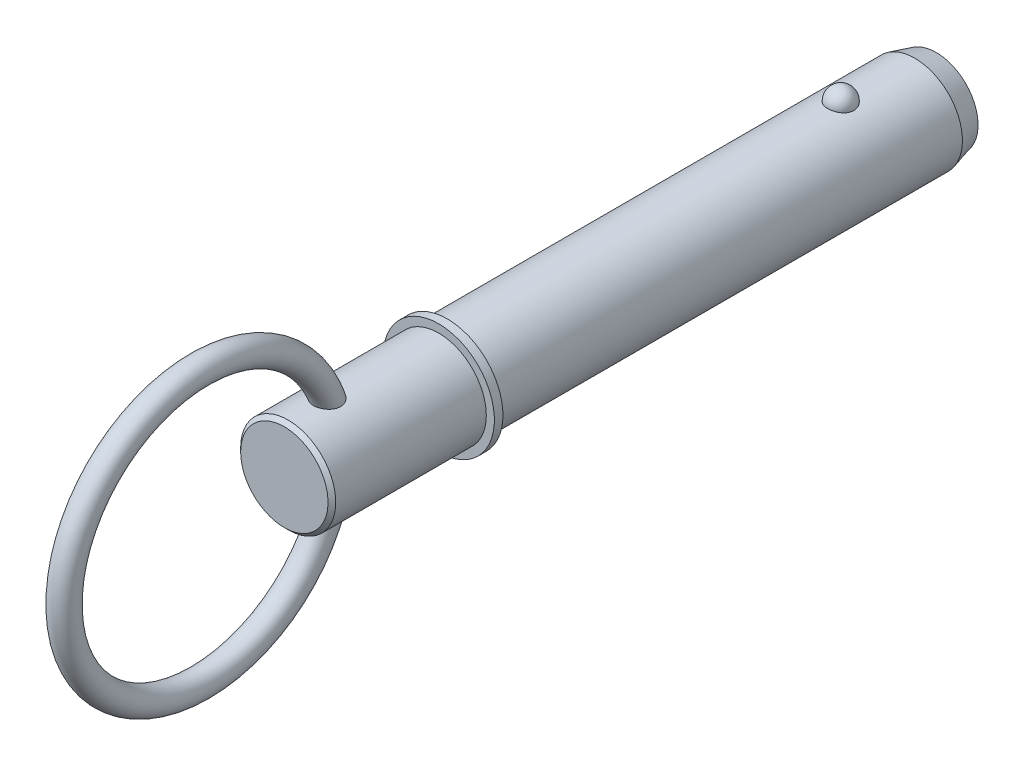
ISO-10303-21;
HEADER;
FILE_DESCRIPTION(('STEP AP214'),'2;1');
FILE_NAME('part.step','',(''),(''),'','','');
FILE_SCHEMA(('AUTOMOTIVE_DESIGN { 1 0 10303 214 1 1 1 1 }'));
ENDSEC;
DATA;
#1=APPLICATION_CONTEXT('core data for automotive mechanical design processes');
#2=APPLICATION_PROTOCOL_DEFINITION('international standard','automotive_design',2000,#1);
#3=PRODUCT_CONTEXT('',#1,'mechanical');
#4=PRODUCT('Part','Part','',(#3));
#5=PRODUCT_RELATED_PRODUCT_CATEGORY('part','',(#4));
#6=PRODUCT_DEFINITION_FORMATION('','',#4);
#7=PRODUCT_DEFINITION_CONTEXT('part definition',#1,'design');
#8=PRODUCT_DEFINITION('design','',#6,#7);
#9=PRODUCT_DEFINITION_SHAPE('','',#8);
#10=(LENGTH_UNIT() NAMED_UNIT(*) SI_UNIT(.MILLI.,.METRE.));
#11=(NAMED_UNIT(*) PLANE_ANGLE_UNIT() SI_UNIT($,.RADIAN.));
#12=(NAMED_UNIT(*) SI_UNIT($,.STERADIAN.) SOLID_ANGLE_UNIT());
#13=UNCERTAINTY_MEASURE_WITH_UNIT(LENGTH_MEASURE(1.E-05),#10,'distance_accuracy_value','');
#14=(GEOMETRIC_REPRESENTATION_CONTEXT(3) GLOBAL_UNCERTAINTY_ASSIGNED_CONTEXT((#13)) GLOBAL_UNIT_ASSIGNED_CONTEXT((#10,
#11,#12)) REPRESENTATION_CONTEXT('',''));
#15=CARTESIAN_POINT('',(0.,0.,0.));
#16=DIRECTION('',(0.,0.,1.));
#17=DIRECTION('',(1.,0.,0.));
#18=AXIS2_PLACEMENT_3D('',#15,#16,#17);
#19=CARTESIAN_POINT('',(0.,0.,88.9));
#20=DIRECTION('',(0.,0.,-1.));
#21=DIRECTION('',(-1.,0.,0.));
#22=AXIS2_PLACEMENT_3D('',#19,#20,#21);
#23=CYLINDRICAL_SURFACE('',#22,11.115);
#24=CARTESIAN_POINT('',(3.04058343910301,10.6910278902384,-3.07));
#25=CARTESIAN_POINT('',(3.04058039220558,10.6910304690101,-2.89837124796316));
#26=CARTESIAN_POINT('',(3.02657193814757,10.6950430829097,-2.72670368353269));
#27=CARTESIAN_POINT('',(2.97087341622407,10.7106465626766,-2.38822964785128));
#28=CARTESIAN_POINT('',(2.92917240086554,10.7222404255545,-2.22142512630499));
#29=CARTESIAN_POINT('',(2.81915317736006,10.751689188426,-1.89750816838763));
#30=CARTESIAN_POINT('',(2.75084669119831,10.7695413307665,-1.7403914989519));
#31=CARTESIAN_POINT('',(2.58932284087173,10.809510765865,-1.44013959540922));
#32=CARTESIAN_POINT('',(2.49610617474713,10.8316279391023,-1.29700396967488));
#33=CARTESIAN_POINT('',(2.28659317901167,10.877786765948,-1.02797591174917));
#34=CARTESIAN_POINT('',(2.17018825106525,10.9018371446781,-0.902169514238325));
#35=CARTESIAN_POINT('',(1.91759004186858,10.9490888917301,-0.672091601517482));
#36=CARTESIAN_POINT('',(1.78139672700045,10.9722902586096,-0.567820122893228));
#37=CARTESIAN_POINT('',(1.49327884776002,11.0151925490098,-0.383992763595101));
#38=CARTESIAN_POINT('',(1.34139928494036,11.034903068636,-0.304368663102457));
#39=CARTESIAN_POINT('',(1.02584823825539,11.0686948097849,-0.171731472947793));
#40=CARTESIAN_POINT('',(0.86217801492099,11.0827766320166,-0.118715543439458));
#41=CARTESIAN_POINT('',(0.530748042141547,11.1035404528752,-0.0415304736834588));
#42=CARTESIAN_POINT('',(0.363109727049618,11.1103474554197,-0.0168734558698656));
#43=CARTESIAN_POINT('',(0.0259327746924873,11.1162480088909,0.00453486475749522));
#44=CARTESIAN_POINT('',(-0.143605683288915,11.1153422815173,0.00128877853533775));
#45=CARTESIAN_POINT('',(-0.477280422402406,11.1059854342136,-0.0327676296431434));
#46=CARTESIAN_POINT('',(-0.641459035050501,11.0976393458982,-0.0631942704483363));
#47=CARTESIAN_POINT('',(-0.962236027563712,11.0744390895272,-0.150220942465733));
#48=CARTESIAN_POINT('',(-1.11883427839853,11.0595848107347,-0.206821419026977));
#49=CARTESIAN_POINT('',(-1.4210461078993,11.0248420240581,-0.345028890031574));
#50=CARTESIAN_POINT('',(-1.56659244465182,11.0049254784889,-0.426775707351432));
#51=CARTESIAN_POINT('',(-1.84189316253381,10.9622119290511,-0.612956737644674));
#52=CARTESIAN_POINT('',(-1.97164597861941,10.9394146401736,-0.717393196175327));
#53=CARTESIAN_POINT('',(-2.21432263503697,10.8929139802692,-0.948332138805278));
#54=CARTESIAN_POINT('',(-2.3268890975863,10.8692016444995,-1.07520847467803));
#55=CARTESIAN_POINT('',(-2.52940007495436,10.8238699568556,-1.34622145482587));
#56=CARTESIAN_POINT('',(-2.6193430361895,10.8022507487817,-1.49035928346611));
#57=CARTESIAN_POINT('',(-2.77523958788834,10.7632629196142,-1.79367507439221));
#58=CARTESIAN_POINT('',(-2.8409151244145,10.7459442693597,-1.95300253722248));
#59=CARTESIAN_POINT('',(-2.94519180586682,10.7178360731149,-2.28083009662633));
#60=CARTESIAN_POINT('',(-2.98379371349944,10.707046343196,-2.44932993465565));
#61=CARTESIAN_POINT('',(-3.03284665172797,10.6932559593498,-2.78998091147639));
#62=CARTESIAN_POINT('',(-3.04341313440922,10.6902233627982,-2.96211412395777));
#63=CARTESIAN_POINT('',(-3.03646037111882,10.6922002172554,-3.30576225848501));
#64=CARTESIAN_POINT('',(-3.0189418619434,10.6972094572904,-3.47727719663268));
#65=CARTESIAN_POINT('',(-2.95641582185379,10.7146564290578,-3.81396465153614));
#66=CARTESIAN_POINT('',(-2.91154117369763,10.7270582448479,-3.97916375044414));
#67=CARTESIAN_POINT('',(-2.79553341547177,10.7578713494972,-4.29947360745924));
#68=CARTESIAN_POINT('',(-2.72439927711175,10.7762828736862,-4.45458397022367));
#69=CARTESIAN_POINT('',(-2.55718900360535,10.8171819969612,-4.75123550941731));
#70=CARTESIAN_POINT('',(-2.46098224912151,10.8396907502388,-4.89270014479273));
#71=CARTESIAN_POINT('',(-2.24623042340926,10.8862165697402,-5.15724095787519));
#72=CARTESIAN_POINT('',(-2.12768452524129,10.9102336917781,-5.28031645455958));
#73=CARTESIAN_POINT('',(-1.87085107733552,10.9571990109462,-5.50509615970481));
#74=CARTESIAN_POINT('',(-1.73249451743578,10.9801430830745,-5.60672245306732));
#75=CARTESIAN_POINT('',(-1.44010079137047,11.0223008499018,-5.78517789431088));
#76=CARTESIAN_POINT('',(-1.28606470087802,11.0415148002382,-5.86200874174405));
#77=CARTESIAN_POINT('',(-0.968615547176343,11.0738491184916,-5.98788441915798));
#78=CARTESIAN_POINT('',(-0.805339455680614,11.0870408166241,-6.03725610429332));
#79=CARTESIAN_POINT('',(-0.47244987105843,11.1062048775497,-6.10820004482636));
#80=CARTESIAN_POINT('',(-0.302837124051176,11.11217808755,-6.12977556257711));
#81=CARTESIAN_POINT('',(0.0345765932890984,11.1162034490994,-6.1443619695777));
#82=CARTESIAN_POINT('',(0.20235372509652,11.1143988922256,-6.13788957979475));
#83=CARTESIAN_POINT('',(0.534364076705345,11.103390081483,-6.09773981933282));
#84=CARTESIAN_POINT('',(0.698597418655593,11.094186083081,-6.06406338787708));
#85=CARTESIAN_POINT('',(1.01830314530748,11.0694136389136,-5.97063285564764));
#86=CARTESIAN_POINT('',(1.17380497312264,11.0538682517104,-5.91097318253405));
#87=CARTESIAN_POINT('',(1.472484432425,11.0180608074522,-5.76723645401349));
#88=CARTESIAN_POINT('',(1.6156613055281,10.9977984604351,-5.68315789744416));
#89=CARTESIAN_POINT('',(1.88801614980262,10.9543574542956,-5.49138807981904));
#90=CARTESIAN_POINT('',(2.01695079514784,10.9311394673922,-5.38336024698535));
#91=CARTESIAN_POINT('',(2.25501495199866,10.8845248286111,-5.14733839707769));
#92=CARTESIAN_POINT('',(2.36414099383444,10.8611281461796,-5.01934088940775));
#93=CARTESIAN_POINT('',(2.56152595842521,10.8162958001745,-4.74447932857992));
#94=CARTESIAN_POINT('',(2.64940088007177,10.7948999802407,-4.59733288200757));
#95=CARTESIAN_POINT('',(2.79961494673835,10.7569242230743,-4.29001203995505));
#96=CARTESIAN_POINT('',(2.86196390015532,10.7403424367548,-4.1298426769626));
#97=CARTESIAN_POINT('',(2.95377333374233,10.715429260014,-3.82062342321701));
#98=CARTESIAN_POINT('',(2.98627018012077,10.7063495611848,-3.67252681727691));
#99=CARTESIAN_POINT('',(3.02967634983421,10.6941478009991,-3.37296350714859));
#100=CARTESIAN_POINT('',(3.04058612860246,10.6910256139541,-3.2214968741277));
#101=CARTESIAN_POINT('',(3.04058343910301,10.6910278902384,-3.07));
#102=B_SPLINE_CURVE_WITH_KNOTS('',3,(#24,#25,#26,#27,#28,#29,#30,#31,#32,#33,#34,#35,#36,#37,
#38,#39,#40,#41,#42,#43,#44,#45,#46,#47,#48,#49,#50,#51,#52,#53,#54,#55,#56,#57,#58,#59,#60,#61,
#62,#63,#64,#65,#66,#67,#68,#69,#70,#71,#72,#73,#74,#75,#76,#77,#78,#79,#80,#81,#82,#83,#84,#85,
#86,#87,#88,#89,#90,#91,#92,#93,#94,#95,#96,#97,#98,#99,#100,#101),.UNSPECIFIED.,.T.,.F.,(4,2,2,
2,2,2,2,2,2,2,2,2,2,2,2,2,2,2,2,2,2,2,2,2,2,2,2,2,2,2,2,2,2,2,2,2,2,2,4),(0.,0.514341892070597,
1.02888723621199,1.54320613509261,2.0575106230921,2.57428293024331,3.09105611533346,
3.60638589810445,4.1216606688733,4.62793159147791,5.1341551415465,5.63334381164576,
6.13254097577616,6.63456562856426,7.13663998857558,7.64804063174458,8.15947638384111,
8.6766026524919,9.19371435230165,9.70869321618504,10.223658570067,10.7361421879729,
11.2486458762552,11.7638748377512,12.2791228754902,12.7962115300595,13.3132647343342,
13.8240238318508,14.3347229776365,14.8360540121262,15.3373677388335,15.8368746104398,
16.3364121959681,16.8434736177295,17.3506237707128,17.8663484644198,18.3818748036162,
18.8358944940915,19.2899046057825),.UNSPECIFIED.);
#103=CARTESIAN_POINT('',(3.04058343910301,10.6910278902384,-3.07));
#104=VERTEX_POINT('',#103);
#105=EDGE_CURVE('E102',#104,#104,#102,.T.);
#106=ORIENTED_EDGE('',*,*,#105,.T.);
#107=EDGE_LOOP('',(#106));
#108=FACE_BOUND('',#107,.T.);
#109=CARTESIAN_POINT('',(0.,0.,-20.3999999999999));
#110=DIRECTION('',(0.,0.,-1.));
#111=DIRECTION('',(-1.,0.,0.));
#112=AXIS2_PLACEMENT_3D('',#109,#110,#111);
#113=CIRCLE('',#112,11.115);
#114=CARTESIAN_POINT('',(-11.115,0.,-20.3999999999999));
#115=VERTEX_POINT('',#114);
#116=EDGE_CURVE('E109',#115,#115,#113,.F.);
#117=ORIENTED_EDGE('',*,*,#116,.T.);
#118=EDGE_LOOP('',(#117));
#119=FACE_BOUND('',#118,.T.);
#120=CARTESIAN_POINT('',(0.,0.,88.9));
#121=DIRECTION('',(0.,0.,1.));
#122=DIRECTION('',(1.,0.,0.));
#123=AXIS2_PLACEMENT_3D('',#120,#121,#122);
#124=CIRCLE('',#123,11.115);
#125=CARTESIAN_POINT('',(11.115,0.,88.9));
#126=VERTEX_POINT('',#125);
#127=EDGE_CURVE('E107',#126,#126,#124,.T.);
#128=ORIENTED_EDGE('',*,*,#127,.F.);
#129=EDGE_LOOP('',(#128));
#130=FACE_BOUND('',#129,.T.);
#131=ADVANCED_FACE('F39',(#108,#119,#130),#23,.T.);
#132=CARTESIAN_POINT('',(0.,0.,-25.4));
#133=DIRECTION('',(0.,0.,-1.));
#134=DIRECTION('',(-1.,0.,0.));
#135=AXIS2_PLACEMENT_3D('',#132,#133,#134);
#136=PLANE('',#135);
#137=CARTESIAN_POINT('',(0.,0.,-25.4));
#138=DIRECTION('',(0.,0.,-1.));
#139=DIRECTION('',(-1.,0.,0.));
#140=AXIS2_PLACEMENT_3D('',#137,#138,#139);
#141=CIRCLE('',#140,9.77525403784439);
#142=CARTESIAN_POINT('',(-9.77525403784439,0.,-25.4));
#143=VERTEX_POINT('',#142);
#144=EDGE_CURVE('E142',#143,#143,#141,.T.);
#145=ORIENTED_EDGE('',*,*,#144,.T.);
#146=EDGE_LOOP('',(#145));
#147=FACE_BOUND('',#146,.T.);
#148=ADVANCED_FACE('F88',(#147),#136,.T.);
#149=CARTESIAN_POINT('',(0.,0.,-25.4));
#150=DIRECTION('',(0.,0.,1.));
#151=DIRECTION('',(1.,0.,0.));
#152=AXIS2_PLACEMENT_3D('',#149,#150,#151);
#153=CONICAL_SURFACE('',#152,9.77525403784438,0.261799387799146);
#154=ORIENTED_EDGE('',*,*,#116,.F.);
#155=EDGE_LOOP('',(#154));
#156=FACE_BOUND('',#155,.T.);
#157=ORIENTED_EDGE('',*,*,#144,.F.);
#158=EDGE_LOOP('',(#157));
#159=FACE_BOUND('',#158,.T.);
#160=ADVANCED_FACE('F94',(#156,#159),#153,.T.);
#161=CARTESIAN_POINT('',(0.,11.115,-3.07));
#162=DIRECTION('',(0.,1.,0.));
#163=DIRECTION('',(0.,0.,1.));
#164=AXIS2_PLACEMENT_3D('',#161,#162,#163);
#165=SPHERICAL_SURFACE('',#164,3.07);
#166=ORIENTED_EDGE('',*,*,#105,.F.);
#167=EDGE_LOOP('',(#166));
#168=FACE_BOUND('',#167,.T.);
#169=ADVANCED_FACE('F112',(#168),#165,.T.);
#170=CARTESIAN_POINT('',(0.,0.,88.9));
#171=DIRECTION('',(0.,0.,-1.));
#172=DIRECTION('',(-1.,0.,0.));
#173=AXIS2_PLACEMENT_3D('',#170,#171,#172);
#174=PLANE('',#173);
#175=ORIENTED_EDGE('',*,*,#127,.T.);
#176=EDGE_LOOP('',(#175));
#177=FACE_BOUND('',#176,.T.);
#178=CARTESIAN_POINT('',(0.,0.,88.9));
#179=DIRECTION('',(0.,0.,-1.));
#180=DIRECTION('',(-1.,0.,0.));
#181=AXIS2_PLACEMENT_3D('',#178,#179,#180);
#182=CIRCLE('',#181,13.);
#183=CARTESIAN_POINT('',(-13.,0.,88.9));
#184=VERTEX_POINT('',#183);
#185=EDGE_CURVE('E108',#184,#184,#182,.T.);
#186=ORIENTED_EDGE('',*,*,#185,.T.);
#187=EDGE_LOOP('',(#186));
#188=FACE_BOUND('',#187,.T.);
#189=ADVANCED_FACE('F116',(#177,#188),#174,.T.);
#190=CARTESIAN_POINT('',(0.,0.,33.7287874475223));
#191=DIRECTION('',(0.,0.,-1.));
#192=DIRECTION('',(-1.,0.,0.));
#193=AXIS2_PLACEMENT_3D('',#190,#191,#192);
#194=CYLINDRICAL_SURFACE('',#193,13.);
#195=CARTESIAN_POINT('',(0.,0.,90.9));
#196=DIRECTION('',(0.,0.,-1.));
#197=DIRECTION('',(-1.,0.,0.));
#198=AXIS2_PLACEMENT_3D('',#195,#196,#197);
#199=CIRCLE('',#198,13.);
#200=CARTESIAN_POINT('',(-13.,0.,90.9));
#201=VERTEX_POINT('',#200);
#202=EDGE_CURVE('E133',#201,#201,#199,.T.);
#203=ORIENTED_EDGE('',*,*,#202,.T.);
#204=EDGE_LOOP('',(#203));
#205=FACE_BOUND('',#204,.T.);
#206=ORIENTED_EDGE('',*,*,#185,.F.);
#207=EDGE_LOOP('',(#206));
#208=FACE_BOUND('',#207,.T.);
#209=ADVANCED_FACE('F120',(#205,#208),#194,.T.);
#210=CARTESIAN_POINT('',(0.,13.,90.9));
#211=DIRECTION('',(0.,0.,1.));
#212=DIRECTION('',(1.,0.,0.));
#213=AXIS2_PLACEMENT_3D('',#210,#211,#212);
#214=PLANE('',#213);
#215=CARTESIAN_POINT('',(0.,0.,90.9));
#216=DIRECTION('',(0.,0.,1.));
#217=DIRECTION('',(1.,0.,0.));
#218=AXIS2_PLACEMENT_3D('',#215,#216,#217);
#219=CIRCLE('',#218,11.115);
#220=CARTESIAN_POINT('',(11.115,0.,90.9));
#221=VERTEX_POINT('',#220);
#222=EDGE_CURVE('E111',#221,#221,#219,.T.);
#223=ORIENTED_EDGE('',*,*,#222,.F.);
#224=EDGE_LOOP('',(#223));
#225=FACE_BOUND('',#224,.T.);
#226=ORIENTED_EDGE('',*,*,#202,.F.);
#227=EDGE_LOOP('',(#226));
#228=FACE_BOUND('',#227,.T.);
#229=ADVANCED_FACE('F85',(#225,#228),#214,.T.);
#230=CARTESIAN_POINT('',(0.,0.,127.));
#231=DIRECTION('',(0.,0.,-1.));
#232=DIRECTION('',(-1.,0.,0.));
#233=AXIS2_PLACEMENT_3D('',#230,#231,#232);
#234=CYLINDRICAL_SURFACE('',#233,11.115);
#235=CARTESIAN_POINT('',(-1.22435852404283,-11.0473603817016,114.078419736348));
#236=CARTESIAN_POINT('',(-1.07078016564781,-11.0643805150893,114.011699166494));
#237=CARTESIAN_POINT('',(-0.911372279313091,-11.0787777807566,113.957745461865));
#238=CARTESIAN_POINT('',(-0.585451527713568,-11.1007717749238,113.876552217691));
#239=CARTESIAN_POINT('',(-0.418938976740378,-11.1083688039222,113.849311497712));
#240=CARTESIAN_POINT('',(-0.0835394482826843,-11.1159515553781,113.822121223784));
#241=CARTESIAN_POINT('',(0.0853474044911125,-11.1159376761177,113.822170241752));
#242=CARTESIAN_POINT('',(0.420723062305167,-11.1083011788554,113.849554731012));
#243=CARTESIAN_POINT('',(0.587211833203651,-11.1006784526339,113.876890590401));
#244=CARTESIAN_POINT('',(0.913189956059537,-11.0786293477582,113.95829957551));
#245=CARTESIAN_POINT('',(1.07267378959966,-11.0641977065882,114.012393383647));
#246=CARTESIAN_POINT('',(1.3799404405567,-11.0300907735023,114.146140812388));
#247=CARTESIAN_POINT('',(1.52772335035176,-11.0104155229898,114.225794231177));
#248=CARTESIAN_POINT('',(1.80679367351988,-10.9680716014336,114.408467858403));
#249=CARTESIAN_POINT('',(1.93814041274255,-10.945414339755,114.511400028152));
#250=CARTESIAN_POINT('',(2.18117403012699,-10.8995884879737,114.738212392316));
#251=CARTESIAN_POINT('',(2.29286356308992,-10.8764199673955,114.862089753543));
#252=CARTESIAN_POINT('',(2.49238969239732,-10.8324319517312,115.125992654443));
#253=CARTESIAN_POINT('',(2.58046870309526,-10.8115899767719,115.265831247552));
#254=CARTESIAN_POINT('',(2.73218762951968,-10.7742522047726,115.558691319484));
#255=CARTESIAN_POINT('',(2.7958294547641,-10.757756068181,115.711711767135));
#256=CARTESIAN_POINT('',(2.89767977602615,-10.7307723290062,116.0266092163));
#257=CARTESIAN_POINT('',(2.93586554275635,-10.7202900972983,116.188493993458));
#258=CARTESIAN_POINT('',(2.98678800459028,-10.7062139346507,116.516480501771));
#259=CARTESIAN_POINT('',(2.99951894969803,-10.7026215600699,116.682583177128));
#260=CARTESIAN_POINT('',(3.0004780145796,-10.7023530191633,117.023227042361));
#261=CARTESIAN_POINT('',(2.98743421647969,-10.7060358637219,117.197770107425));
#262=CARTESIAN_POINT('',(2.93592917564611,-10.7202719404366,117.542750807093));
#263=CARTESIAN_POINT('',(2.89745825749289,-10.7308277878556,117.713186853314));
#264=CARTESIAN_POINT('',(2.79180512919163,-10.7588257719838,118.063114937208));
#265=CARTESIAN_POINT('',(2.72213928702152,-10.776850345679,118.241811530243));
#266=CARTESIAN_POINT('',(2.55612841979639,-10.8174264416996,118.585974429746));
#267=CARTESIAN_POINT('',(2.45975697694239,-10.8399824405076,118.751427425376));
#268=CARTESIAN_POINT('',(2.23434632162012,-10.8887625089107,119.075672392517));
#269=CARTESIAN_POINT('',(2.10349593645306,-10.9151327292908,119.233192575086));
#270=CARTESIAN_POINT('',(1.81505097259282,-10.96677510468,119.521668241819));
#271=CARTESIAN_POINT('',(1.65749731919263,-10.9920488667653,119.65266371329));
#272=CARTESIAN_POINT('',(1.36197799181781,-11.0319737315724,119.851313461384));
#273=CARTESIAN_POINT('',(1.22927684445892,-11.0476896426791,119.92660092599));
#274=CARTESIAN_POINT('',(0.952979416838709,-11.0749380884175,120.054574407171));
#275=CARTESIAN_POINT('',(0.809393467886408,-11.0864745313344,120.107281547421));
#276=CARTESIAN_POINT('',(0.513954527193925,-11.1041011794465,120.187058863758));
#277=CARTESIAN_POINT('',(0.362058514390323,-11.1101594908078,120.213978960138));
#278=CARTESIAN_POINT('',(0.0557792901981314,-11.1159132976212,120.239559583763));
#279=CARTESIAN_POINT('',(-0.0986030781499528,-11.1156109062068,120.238229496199));
#280=CARTESIAN_POINT('',(-0.389768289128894,-11.1090283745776,120.208935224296));
#281=CARTESIAN_POINT('',(-0.526830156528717,-11.1033186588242,120.183512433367));
#282=CARTESIAN_POINT('',(-0.79487824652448,-11.0873547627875,120.111270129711));
#283=CARTESIAN_POINT('',(-0.925863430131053,-11.0770998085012,120.064446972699));
#284=CARTESIAN_POINT('',(-1.18354406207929,-11.0525934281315,119.949843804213));
#285=CARTESIAN_POINT('',(-1.30991621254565,-11.0382116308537,119.881371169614));
#286=CARTESIAN_POINT('',(-1.55122352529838,-11.0068962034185,119.727131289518));
#287=CARTESIAN_POINT('',(-1.66615377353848,-10.9899614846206,119.641356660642));
#288=CARTESIAN_POINT('',(-1.90024050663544,-10.9520991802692,119.44087205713));
#289=CARTESIAN_POINT('',(-2.01728342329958,-10.9309598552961,119.323737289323));
#290=CARTESIAN_POINT('',(-2.23333659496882,-10.8888735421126,119.073839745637));
#291=CARTESIAN_POINT('',(-2.33233396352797,-10.8679267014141,118.941065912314));
#292=CARTESIAN_POINT('',(-2.52607041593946,-10.8246766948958,118.640000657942));
#293=CARTESIAN_POINT('',(-2.6174157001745,-10.8027194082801,118.469462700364));
#294=CARTESIAN_POINT('',(-2.77251687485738,-10.7639568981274,118.115671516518));
#295=CARTESIAN_POINT('',(-2.8362578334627,-10.7471544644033,117.932411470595));
#296=CARTESIAN_POINT('',(-2.93668505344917,-10.7201706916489,117.546624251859));
#297=CARTESIAN_POINT('',(-2.97161961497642,-10.7104219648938,117.343594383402));
#298=CARTESIAN_POINT('',(-2.99683495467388,-10.7033740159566,117.036874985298));
#299=CARTESIAN_POINT('',(-3.00070536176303,-10.7022882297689,116.934234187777));
#300=CARTESIAN_POINT('',(-2.99908594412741,-10.7027439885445,116.729049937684));
#301=CARTESIAN_POINT('',(-2.99360154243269,-10.7042840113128,116.626506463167));
#302=CARTESIAN_POINT('',(-2.97382504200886,-10.7097936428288,116.430330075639));
#303=CARTESIAN_POINT('',(-2.9602439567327,-10.7135669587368,116.336619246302));
#304=CARTESIAN_POINT('',(-2.92480741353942,-10.723295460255,116.150932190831));
#305=CARTESIAN_POINT('',(-2.90295619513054,-10.7292495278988,116.05895510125));
#306=CARTESIAN_POINT('',(-2.8509700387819,-10.7431800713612,115.877547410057));
#307=CARTESIAN_POINT('',(-2.82083748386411,-10.7511559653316,115.788116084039));
#308=CARTESIAN_POINT('',(-2.75241691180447,-10.7688750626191,115.61264532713));
#309=CARTESIAN_POINT('',(-2.71412954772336,-10.7786181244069,115.52660562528));
#310=CARTESIAN_POINT('',(-2.59550576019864,-10.807996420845,115.291055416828));
#311=CARTESIAN_POINT('',(-2.50612224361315,-10.8292837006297,115.146173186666));
#312=CARTESIAN_POINT('',(-2.30366035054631,-10.8741467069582,114.874571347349));
#313=CARTESIAN_POINT('',(-2.19058370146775,-10.8977222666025,114.747850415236));
#314=CARTESIAN_POINT('',(-1.94442412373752,-10.9443154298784,114.516462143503));
#315=CARTESIAN_POINT('',(-1.81141354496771,-10.967334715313,114.41171820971));
#316=CARTESIAN_POINT('',(-1.529042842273,-11.0102504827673,114.226435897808));
#317=CARTESIAN_POINT('',(-1.3796820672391,-11.0301468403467,114.145898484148));
#318=CARTESIAN_POINT('',(-1.22435852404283,-11.0473603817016,114.078419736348));
#319=B_SPLINE_CURVE_WITH_KNOTS('',3,(#235,#236,#237,#238,#239,#240,#241,#242,#243,#244,#245,
#246,#247,#248,#249,#250,#251,#252,#253,#254,#255,#256,#257,#258,#259,#260,#261,#262,#263,#264,
#265,#266,#267,#268,#269,#270,#271,#272,#273,#274,#275,#276,#277,#278,#279,#280,#281,#282,#283,
#284,#285,#286,#287,#288,#289,#290,#291,#292,#293,#294,#295,#296,#297,#298,#299,#300,#301,#302,
#303,#304,#305,#306,#307,#308,#309,#310,#311,#312,#313,#314,#315,#316,#317,#318),.UNSPECIFIED.,
.T.,.F.,(4,2,2,2,2,2,2,2,2,2,2,2,2,2,2,2,2,2,2,2,2,2,2,2,2,2,2,2,2,2,2,2,2,2,2,2,2,2,2,2,2,4),
(0.,0.504317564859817,1.00861284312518,1.51288173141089,2.01715779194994,2.52182424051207,
3.02648670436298,3.52927157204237,4.03198848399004,4.52932690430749,5.02662645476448,
5.52436944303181,6.02222485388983,6.54526169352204,7.06849767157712,7.64398785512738,
8.22004937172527,8.83633461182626,9.45168373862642,9.90997173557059,10.3678300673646,
10.8283372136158,11.2886913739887,11.7053264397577,12.1220324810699,12.5537129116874,
12.9855779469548,13.4844842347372,13.9837454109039,14.565330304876,15.1472294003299,
15.762338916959,16.0701226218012,16.3777279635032,16.6616380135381,16.9454027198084,
17.229085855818,17.5127462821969,18.0246262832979,18.5364689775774,19.0464970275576,
19.5565453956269),.UNSPECIFIED.);
#320=CARTESIAN_POINT('',(-1.22435852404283,-11.0473603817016,114.078419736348));
#321=VERTEX_POINT('',#320);
#322=EDGE_CURVE('E10',#321,#321,#319,.T.);
#323=ORIENTED_EDGE('',*,*,#322,.F.);
#324=EDGE_LOOP('',(#323));
#325=FACE_BOUND('',#324,.T.);
#326=CARTESIAN_POINT('',(-1.22435852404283,11.0473603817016,114.078419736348));
#327=CARTESIAN_POINT('',(-1.37630771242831,11.0305212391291,114.144431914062));
#328=CARTESIAN_POINT('',(-1.52254325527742,11.0111158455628,114.222938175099));
#329=CARTESIAN_POINT('',(-1.79945383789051,10.9692671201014,114.40315338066));
#330=CARTESIAN_POINT('',(-1.93013010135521,10.9468240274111,114.504860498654));
#331=CARTESIAN_POINT('',(-2.17227655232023,10.9013603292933,114.729035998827));
#332=CARTESIAN_POINT('',(-2.28373752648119,10.8783394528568,114.851514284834));
#333=CARTESIAN_POINT('',(-2.4842745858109,10.8343057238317,115.113895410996));
#334=CARTESIAN_POINT('',(-2.57335330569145,10.8132926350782,115.253796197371));
#335=CARTESIAN_POINT('',(-2.7264007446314,10.7757209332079,115.545964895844));
#336=CARTESIAN_POINT('',(-2.79054231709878,10.7591319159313,115.69813851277));
#337=CARTESIAN_POINT('',(-2.89354234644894,10.7318913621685,116.011286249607));
#338=CARTESIAN_POINT('',(-2.93239912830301,10.7212402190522,116.172260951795));
#339=CARTESIAN_POINT('',(-2.98540436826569,10.7066038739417,116.501955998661));
#340=CARTESIAN_POINT('',(-2.9990165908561,10.7027634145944,116.670768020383));
#341=CARTESIAN_POINT('',(-3.00088147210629,10.7022388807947,117.008508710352));
#342=CARTESIAN_POINT('',(-2.98912652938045,10.7055569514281,117.177437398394));
#343=CARTESIAN_POINT('',(-2.93985175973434,10.7191979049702,117.524856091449));
#344=CARTESIAN_POINT('',(-2.90036626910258,10.7300544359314,117.703044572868));
#345=CARTESIAN_POINT('',(-2.79555002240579,10.7578360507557,118.051215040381));
#346=CARTESIAN_POINT('',(-2.73019988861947,10.774765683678,118.221190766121));
#347=CARTESIAN_POINT('',(-2.56762574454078,10.8147227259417,118.565784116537));
#348=CARTESIAN_POINT('',(-2.46786230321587,10.838191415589,118.739157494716));
#349=CARTESIAN_POINT('',(-2.24100420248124,10.8873575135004,119.066686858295));
#350=CARTESIAN_POINT('',(-2.11391925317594,10.9130541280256,119.220849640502));
#351=CARTESIAN_POINT('',(-1.85542700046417,10.9597063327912,119.482735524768));
#352=CARTESIAN_POINT('',(-1.72758345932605,10.9807909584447,119.593955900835));
#353=CARTESIAN_POINT('',(-1.45489931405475,11.0202250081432,119.79412236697));
#354=CARTESIAN_POINT('',(-1.31006770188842,11.0385758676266,119.883080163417));
#355=CARTESIAN_POINT('',(-1.08171164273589,11.0625084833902,119.9963702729));
#356=CARTESIAN_POINT('',(-1.00332234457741,11.069914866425,120.030896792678));
#357=CARTESIAN_POINT('',(-0.843525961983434,11.0832350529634,120.092391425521));
#358=CARTESIAN_POINT('',(-0.762120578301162,11.0891496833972,120.119363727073));
#359=CARTESIAN_POINT('',(-0.597014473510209,11.0992628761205,120.16518193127));
#360=CARTESIAN_POINT('',(-0.513315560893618,11.1034627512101,120.184034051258));
#361=CARTESIAN_POINT('',(-0.34437442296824,11.1099851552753,120.213209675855));
#362=CARTESIAN_POINT('',(-0.259132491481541,11.1123080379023,120.223534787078));
#363=CARTESIAN_POINT('',(-0.100838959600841,11.114780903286,120.234519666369));
#364=CARTESIAN_POINT('',(-0.0278735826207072,11.1152042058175,120.236395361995));
#365=CARTESIAN_POINT('',(0.117962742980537,11.1146132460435,120.233773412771));
#366=CARTESIAN_POINT('',(0.190833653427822,11.1135985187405,120.229273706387));
#367=CARTESIAN_POINT('',(0.335842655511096,11.110161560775,120.213978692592));
#368=CARTESIAN_POINT('',(0.40798108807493,11.1077400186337,120.203186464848));
#369=CARTESIAN_POINT('',(0.551029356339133,11.1015643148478,120.175503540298));
#370=CARTESIAN_POINT('',(0.621938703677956,11.0978096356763,120.158610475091));
#371=CARTESIAN_POINT('',(0.825381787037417,11.0851145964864,120.101054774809));
#372=CARTESIAN_POINT('',(0.955713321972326,11.0745538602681,120.052705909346));
#373=CARTESIAN_POINT('',(1.20733127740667,11.0499605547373,119.937325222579));
#374=CARTESIAN_POINT('',(1.32861527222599,11.0359270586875,119.870288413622));
#375=CARTESIAN_POINT('',(1.5734436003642,11.0038352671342,119.711843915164));
#376=CARTESIAN_POINT('',(1.69572941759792,10.9855025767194,119.618551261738));
#377=CARTESIAN_POINT('',(1.9256521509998,10.9475431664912,119.415650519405));
#378=CARTESIAN_POINT('',(2.03328016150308,10.9279156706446,119.306032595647));
#379=CARTESIAN_POINT('',(2.25048911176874,10.8854412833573,119.05299112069));
#380=CARTESIAN_POINT('',(2.35710396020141,10.8626332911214,118.907010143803));
#381=CARTESIAN_POINT('',(2.54757318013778,10.8195493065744,118.600478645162));
#382=CARTESIAN_POINT('',(2.63141052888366,10.799275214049,118.439917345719));
#383=CARTESIAN_POINT('',(2.78342312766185,10.7611645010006,118.087827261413));
#384=CARTESIAN_POINT('',(2.84851472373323,10.7439117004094,117.894893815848));
#385=CARTESIAN_POINT('',(2.94562652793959,10.7177011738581,117.500130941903));
#386=CARTESIAN_POINT('',(2.97764942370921,10.7087427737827,117.29830223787));
#387=CARTESIAN_POINT('',(2.99864828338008,10.7028651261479,116.995989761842));
#388=CARTESIAN_POINT('',(3.00125529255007,10.7021342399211,116.896378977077));
#389=CARTESIAN_POINT('',(2.9976304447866,10.7031517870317,116.697345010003));
#390=CARTESIAN_POINT('',(2.99140295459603,10.704898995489,116.597921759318));
#391=CARTESIAN_POINT('',(2.96990080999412,10.710883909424,116.400179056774));
#392=CARTESIAN_POINT('',(2.95463019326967,10.7151205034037,116.301859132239));
#393=CARTESIAN_POINT('',(2.91493260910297,10.7259879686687,116.107219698));
#394=CARTESIAN_POINT('',(2.89050674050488,10.7326185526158,116.010899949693));
#395=CARTESIAN_POINT('',(2.83556656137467,10.7472556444,115.831222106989));
#396=CARTESIAN_POINT('',(2.80596337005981,10.7550439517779,115.747566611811));
#397=CARTESIAN_POINT('',(2.73953102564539,10.7721572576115,115.583300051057));
#398=CARTESIAN_POINT('',(2.70269935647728,10.7814827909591,115.502690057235));
#399=CARTESIAN_POINT('',(2.62203440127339,10.801383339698,115.345273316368));
#400=CARTESIAN_POINT('',(2.57820565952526,10.8119575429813,115.268464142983));
#401=CARTESIAN_POINT('',(2.48382482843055,10.8340293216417,115.119223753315));
#402=CARTESIAN_POINT('',(2.43327032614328,10.8455272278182,115.046794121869));
#403=CARTESIAN_POINT('',(2.27895739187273,10.879345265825,114.845992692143));
#404=CARTESIAN_POINT('',(2.16717186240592,10.9023791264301,114.723764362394));
#405=CARTESIAN_POINT('',(1.92442677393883,10.9478318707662,114.500151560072));
#406=CARTESIAN_POINT('',(1.79346836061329,10.9702507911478,114.398765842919));
#407=CARTESIAN_POINT('',(1.51657151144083,11.0119360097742,114.219564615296));
#408=CARTESIAN_POINT('',(1.37069187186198,11.0312139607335,114.141661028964));
#409=CARTESIAN_POINT('',(1.06764402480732,11.0646548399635,114.010680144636));
#410=CARTESIAN_POINT('',(0.910475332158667,11.0788175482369,113.957603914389));
#411=CARTESIAN_POINT('',(0.587492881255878,11.1006548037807,113.87697871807));
#412=CARTESIAN_POINT('',(0.421604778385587,11.1082585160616,113.849708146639));
#413=CARTESIAN_POINT('',(0.0874262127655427,11.1159127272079,113.822259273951));
#414=CARTESIAN_POINT('',(-0.0808643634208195,11.1159628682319,113.82208225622));
#415=CARTESIAN_POINT('',(-0.416252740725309,11.1084780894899,113.848918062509));
#416=CARTESIAN_POINT('',(-0.583334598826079,11.1008914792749,113.876116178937));
#417=CARTESIAN_POINT('',(-0.910355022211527,11.0788693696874,113.957401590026));
#418=CARTESIAN_POINT('',(-1.07029370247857,11.064433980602,114.011488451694));
#419=CARTESIAN_POINT('',(-1.22435852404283,11.0473603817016,114.078419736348));
#420=B_SPLINE_CURVE_WITH_KNOTS('',3,(#326,#327,#328,#329,#330,#331,#332,#333,#334,#335,#336,
#337,#338,#339,#340,#341,#342,#343,#344,#345,#346,#347,#348,#349,#350,#351,#352,#353,#354,#355,
#356,#357,#358,#359,#360,#361,#362,#363,#364,#365,#366,#367,#368,#369,#370,#371,#372,#373,#374,
#375,#376,#377,#378,#379,#380,#381,#382,#383,#384,#385,#386,#387,#388,#389,#390,#391,#392,#393,
#394,#395,#396,#397,#398,#399,#400,#401,#402,#403,#404,#405,#406,#407,#408,#409,#410,#411,#412,
#413,#414,#415,#416,#417,#418,#419),.UNSPECIFIED.,.T.,.F.,(4,2,2,2,2,2,2,2,2,2,2,2,2,2,2,2,2,2,
2,2,2,2,2,2,2,2,2,2,2,2,2,2,2,2,2,2,2,2,2,2,2,2,2,2,2,2,4),(0.,0.498977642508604,
0.99791601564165,1.49709295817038,1.99621111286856,2.49180514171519,2.98743199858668,
3.49347125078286,3.99966216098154,4.54591839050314,5.09258465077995,5.69407889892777,
6.29535972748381,6.80565832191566,7.31568801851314,7.57328514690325,7.83073916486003,
8.08799570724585,8.34520376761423,8.56389164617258,8.78265025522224,9.00130188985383,
9.22003849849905,9.63638938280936,10.0528514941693,10.5157946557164,10.9790178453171,
11.5234572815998,12.0683024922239,12.6784825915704,13.288613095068,13.5872082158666,
13.8856557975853,14.1839702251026,14.482248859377,14.7491407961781,15.016125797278,
15.2829381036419,15.5498463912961,16.0489312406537,16.5479862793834,17.0451454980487,
17.542326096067,18.0448111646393,18.5473200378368,19.0532532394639,19.5591782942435),.UNSPECIFIED.);
#421=CARTESIAN_POINT('',(-1.22435852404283,11.0473603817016,114.078419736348));
#422=VERTEX_POINT('',#421);
#423=EDGE_CURVE('E51',#422,#422,#420,.T.);
#424=ORIENTED_EDGE('',*,*,#423,.F.);
#425=EDGE_LOOP('',(#424));
#426=FACE_BOUND('',#425,.T.);
#427=CARTESIAN_POINT('',(0.,0.,126.1));
#428=DIRECTION('',(0.,0.,-1.));
#429=DIRECTION('',(-1.,0.,0.));
#430=AXIS2_PLACEMENT_3D('',#427,#428,#429);
#431=CIRCLE('',#430,11.115);
#432=CARTESIAN_POINT('',(-11.115,0.,126.1));
#433=VERTEX_POINT('',#432);
#434=EDGE_CURVE('E64',#433,#433,#431,.T.);
#435=ORIENTED_EDGE('',*,*,#434,.T.);
#436=EDGE_LOOP('',(#435));
#437=FACE_BOUND('',#436,.T.);
#438=ORIENTED_EDGE('',*,*,#222,.T.);
#439=EDGE_LOOP('',(#438));
#440=FACE_BOUND('',#439,.T.);
#441=ADVANCED_FACE('F69',(#325,#426,#437,#440),#234,.T.);
#442=CARTESIAN_POINT('',(0.,0.,127.));
#443=DIRECTION('',(0.,0.,-1.));
#444=DIRECTION('',(-1.,0.,0.));
#445=AXIS2_PLACEMENT_3D('',#442,#443,#444);
#446=PLANE('',#445);
#447=CARTESIAN_POINT('',(0.,0.,127.));
#448=DIRECTION('',(0.,0.,-1.));
#449=DIRECTION('',(-1.,0.,0.));
#450=AXIS2_PLACEMENT_3D('',#447,#448,#449);
#451=CIRCLE('',#450,10.215);
#452=CARTESIAN_POINT('',(-10.215,0.,127.));
#453=VERTEX_POINT('',#452);
#454=EDGE_CURVE('E58',#453,#453,#451,.F.);
#455=ORIENTED_EDGE('',*,*,#454,.T.);
#456=EDGE_LOOP('',(#455));
#457=FACE_BOUND('',#456,.T.);
#458=ADVANCED_FACE('F76',(#457),#446,.F.);
#459=CARTESIAN_POINT('',(0.,0.,126.1));
#460=DIRECTION('',(0.,0.,-1.));
#461=DIRECTION('',(-1.,0.,0.));
#462=AXIS2_PLACEMENT_3D('',#459,#460,#461);
#463=CONICAL_SURFACE('',#462,11.115,0.785398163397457);
#464=CARTESIAN_POINT('',(-10.215,0.,127.));
#465=CARTESIAN_POINT('',(-10.224375,0.,126.990625));
#466=CARTESIAN_POINT('',(-10.23375,0.,126.98125));
#467=CARTESIAN_POINT('',(-10.2525,0.,126.9625));
#468=CARTESIAN_POINT('',(-10.261875,0.,126.953125));
#469=CARTESIAN_POINT('',(-10.280625,0.,126.934375));
#470=CARTESIAN_POINT('',(-10.29,0.,126.925));
#471=CARTESIAN_POINT('',(-10.30875,0.,126.90625));
#472=CARTESIAN_POINT('',(-10.318125,0.,126.896875));
#473=CARTESIAN_POINT('',(-10.336875,0.,126.878125));
#474=CARTESIAN_POINT('',(-10.34625,0.,126.86875));
#475=CARTESIAN_POINT('',(-10.365,0.,126.85));
#476=CARTESIAN_POINT('',(-10.374375,0.,126.840625));
#477=CARTESIAN_POINT('',(-10.393125,0.,126.821875));
#478=CARTESIAN_POINT('',(-10.4025,0.,126.8125));
#479=CARTESIAN_POINT('',(-10.42125,0.,126.79375));
#480=CARTESIAN_POINT('',(-10.430625,0.,126.784375));
#481=CARTESIAN_POINT('',(-10.449375,0.,126.765625));
#482=CARTESIAN_POINT('',(-10.45875,0.,126.75625));
#483=CARTESIAN_POINT('',(-10.4775,0.,126.7375));
#484=CARTESIAN_POINT('',(-10.486875,0.,126.728125));
#485=CARTESIAN_POINT('',(-10.505625,0.,126.709375));
#486=CARTESIAN_POINT('',(-10.515,0.,126.7));
#487=CARTESIAN_POINT('',(-10.53375,0.,126.68125));
#488=CARTESIAN_POINT('',(-10.543125,0.,126.671875));
#489=CARTESIAN_POINT('',(-10.561875,0.,126.653125));
#490=CARTESIAN_POINT('',(-10.57125,0.,126.64375));
#491=CARTESIAN_POINT('',(-10.59,0.,126.625));
#492=CARTESIAN_POINT('',(-10.599375,0.,126.615625));
#493=CARTESIAN_POINT('',(-10.618125,0.,126.596875));
#494=CARTESIAN_POINT('',(-10.6275,0.,126.5875));
#495=CARTESIAN_POINT('',(-10.64625,0.,126.56875));
#496=CARTESIAN_POINT('',(-10.655625,0.,126.559375));
#497=CARTESIAN_POINT('',(-10.674375,0.,126.540625));
#498=CARTESIAN_POINT('',(-10.68375,0.,126.53125));
#499=CARTESIAN_POINT('',(-10.7025,0.,126.5125));
#500=CARTESIAN_POINT('',(-10.711875,0.,126.503125));
#501=CARTESIAN_POINT('',(-10.730625,0.,126.484375));
#502=CARTESIAN_POINT('',(-10.74,0.,126.475));
#503=CARTESIAN_POINT('',(-10.75875,0.,126.45625));
#504=CARTESIAN_POINT('',(-10.768125,0.,126.446875));
#505=CARTESIAN_POINT('',(-10.786875,0.,126.428125));
#506=CARTESIAN_POINT('',(-10.79625,0.,126.41875));
#507=CARTESIAN_POINT('',(-10.815,0.,126.4));
#508=CARTESIAN_POINT('',(-10.824375,0.,126.390625));
#509=CARTESIAN_POINT('',(-10.843125,0.,126.371875));
#510=CARTESIAN_POINT('',(-10.8525,0.,126.3625));
#511=CARTESIAN_POINT('',(-10.87125,0.,126.34375));
#512=CARTESIAN_POINT('',(-10.880625,0.,126.334375));
#513=CARTESIAN_POINT('',(-10.899375,0.,126.315625));
#514=CARTESIAN_POINT('',(-10.90875,0.,126.30625));
#515=CARTESIAN_POINT('',(-10.9275,0.,126.2875));
#516=CARTESIAN_POINT('',(-10.936875,0.,126.278125));
#517=CARTESIAN_POINT('',(-10.955625,0.,126.259375));
#518=CARTESIAN_POINT('',(-10.965,0.,126.25));
#519=CARTESIAN_POINT('',(-10.98375,0.,126.23125));
#520=CARTESIAN_POINT('',(-10.993125,0.,126.221875));
#521=CARTESIAN_POINT('',(-11.011875,0.,126.203125));
#522=CARTESIAN_POINT('',(-11.02125,0.,126.19375));
#523=CARTESIAN_POINT('',(-11.04,0.,126.175));
#524=CARTESIAN_POINT('',(-11.049375,0.,126.165625));
#525=CARTESIAN_POINT('',(-11.068125,0.,126.146875));
#526=CARTESIAN_POINT('',(-11.0775,0.,126.1375));
#527=CARTESIAN_POINT('',(-11.09625,0.,126.11875));
#528=CARTESIAN_POINT('',(-11.105625,0.,126.109375));
#529=CARTESIAN_POINT('',(-11.115,0.,126.1));
#530=B_SPLINE_CURVE_WITH_KNOTS('',3,(#464,#465,#466,#467,#468,#469,#470,#471,#472,#473,#474,
#475,#476,#477,#478,#479,#480,#481,#482,#483,#484,#485,#486,#487,#488,#489,#490,#491,#492,#493,
#494,#495,#496,#497,#498,#499,#500,#501,#502,#503,#504,#505,#506,#507,#508,#509,#510,#511,#512,
#513,#514,#515,#516,#517,#518,#519,#520,#521,#522,#523,#524,#525,#526,#527,#528,#529),
.UNSPECIFIED.,.F.,.F.,(4,2,2,2,2,2,2,2,2,2,2,2,2,2,2,2,2,2,2,2,2,2,2,2,2,2,2,2,2,2,2,2,4),(0.,
0.0397747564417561,0.0795495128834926,0.11932426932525,0.159099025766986,0.198873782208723,
0.23864853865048,0.278423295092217,0.318198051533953,0.357972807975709,0.397747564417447,
0.437522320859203,0.477297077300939,0.517071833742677,0.556846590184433,0.59662134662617,
0.636396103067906,0.676170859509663,0.7159456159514,0.755720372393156,0.795495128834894,
0.83526988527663,0.875044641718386,0.914819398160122,0.95459415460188,0.994368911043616,
1.03414366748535,1.07391842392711,1.11369318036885,1.15346793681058,1.19324269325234,
1.23301744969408,1.27279220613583),.UNSPECIFIED.);
#531=EDGE_CURVE('BSEAM41',#453,#433,#530,.T.);
#532=ORIENTED_EDGE('',*,*,#454,.F.);
#533=ORIENTED_EDGE('',*,*,#434,.F.);
#534=ORIENTED_EDGE('',*,*,#531,.T.);
#535=ORIENTED_EDGE('',*,*,#531,.F.);
#536=EDGE_LOOP('',(#532,#534,#533,#535));
#537=FACE_BOUND('',#536,.T.);
#538=ADVANCED_FACE('F41',(#537),#463,.T.);
#539=CARTESIAN_POINT('',(0.,0.,146.75));
#540=DIRECTION('',(1.,0.,0.));
#541=DIRECTION('',(0.,0.,-1.));
#542=AXIS2_PLACEMENT_3D('',#539,#540,#541);
#543=TOROIDAL_SURFACE('',#542,31.75,3.);
#544=ORIENTED_EDGE('',*,*,#322,.T.);
#545=EDGE_LOOP('',(#544));
#546=FACE_BOUND('',#545,.T.);
#547=ORIENTED_EDGE('',*,*,#423,.T.);
#548=EDGE_LOOP('',(#547));
#549=FACE_BOUND('',#548,.T.);
#550=ADVANCED_FACE('F73',(#546,#549),#543,.T.);
#551=CLOSED_SHELL('',(#131,#148,#160,#169,#189,#209,#229,#441,#458,#538,#550));
#552=MANIFOLD_SOLID_BREP('B2',#551);
#553=ADVANCED_BREP_SHAPE_REPRESENTATION('',(#18,#552),#14);
#554=SHAPE_DEFINITION_REPRESENTATION(#9,#553);
ENDSEC;
END-ISO-10303-21;
